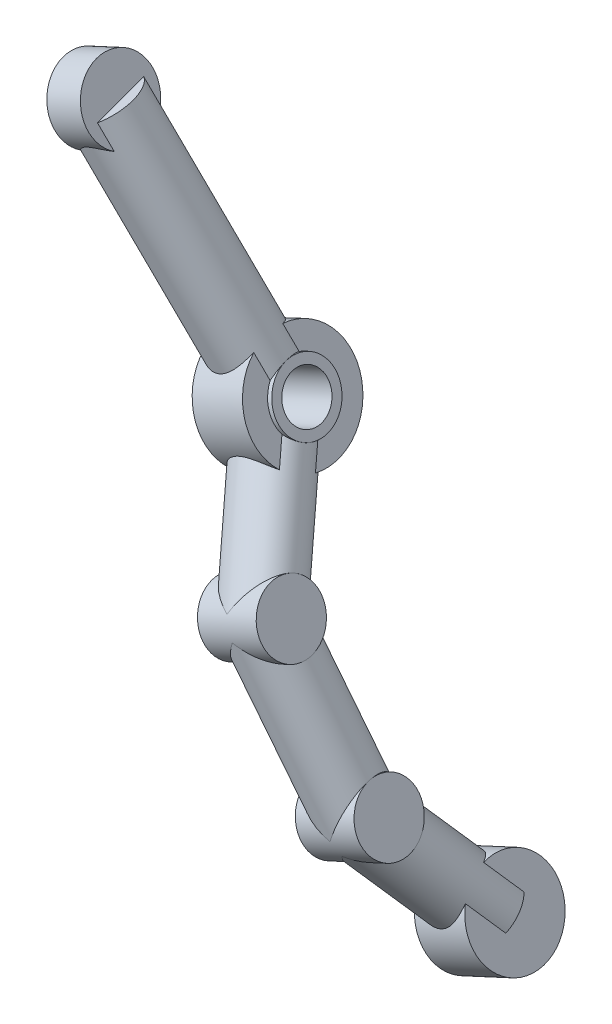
from build123d import *

# Parameters (mm, degrees)
BRAZO_1_PROFILE_R        = 3.5
BRAZO_2_PROFILE_R        = 3.5
BRAZO_3_PROFILE_R        = 3.5
BRAZO_4_PROFILE_R        = 3.5
BRAZO_CODO_1_PROFILE_R   = 3.5
BRAZO_CODO_2_PROFILE_R   = 3.5
BRAZO_CODO_3_PROFILE_R   = 3.5
OJO_PIVOTE_PROFILE_R     = 6
ANCLAJE_CABLE_PROFILE_R  = 4
OJO_ZAPATA_PROFILE_R     = 5
TALADRO_PIVOTE_PROFILE_R = 2.5


with BuildPart() as part:
    # Brazo_1: sweep along a curve in space
    with BuildLine() as brazo_1_path:
        Line((424.61087669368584, 411.57911876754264, 33), (436.3979905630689, 386.1810096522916, 26))
    # Brazo_1 profile (on start of the path) → Brazo_1 (sweep)
    with BuildSketch(Plane(origin=(424.61087669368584, 411.57911876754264, 33), x_dir=(-0.9070753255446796, -0.42096835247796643, 0), z_dir=(0.40839928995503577, -0.8799923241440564, -0.24253562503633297))):
        Circle(BRAZO_1_PROFILE_R)
    sweep(path=brazo_1_path.line)

    # Brazo_2: sweep along a curve in space
    with BuildLine() as brazo_2_path:
        Line((436.3979905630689, 386.1810096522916, 26), (442.7125158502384, 372.5748797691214, 34))
    # Brazo_2 profile (on start of the path) → Brazo_2 (sweep)
    with BuildSketch(Plane(origin=(436.3979905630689, 386.1810096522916, 26), x_dir=(0, -0.5068503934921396, -0.8620340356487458), z_dir=(0.37144266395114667, -0.8003605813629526, 0.47058823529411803))):
        Circle(BRAZO_2_PROFILE_R)
    sweep(path=brazo_2_path.line)

    # Brazo_3: sweep along a curve in space
    with BuildLine() as brazo_3_path:
        Line((442.7125158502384, 372.5748797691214, 34), (450.28994619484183, 356.2475239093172, 31))
    # Brazo_3 profile (on start of the path) → Brazo_3 (sweep)
    with BuildSketch(Plane(origin=(442.7125158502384, 372.5748797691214, 34), x_dir=(-0.9070753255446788, -0.42096835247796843, 0), z_dir=(0.4152406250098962, -0.8947335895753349, -0.16439898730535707))):
        Circle(BRAZO_3_PROFILE_R)
    sweep(path=brazo_3_path.line)

    # Brazo_4: sweep along a curve in space
    with BuildLine() as brazo_4_path:
        Line((450.28994619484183, 356.2475239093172, 31), (455.3415664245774, 345.36262000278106, 22))
    # Brazo_4 profile (on start of the path) → Brazo_4 (sweep)
    with BuildSketch(Plane(origin=(450.28994619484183, 356.2475239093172, 31), x_dir=(0, 0.6372232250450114, -0.7706792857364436), z_dir=(0.33677468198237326, -0.7256602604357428, -0.600000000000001))):
        Circle(BRAZO_4_PROFILE_R)
    sweep(path=brazo_4_path.line)

    # Brazo_codo_1: sweep along a curve in space
    with BuildLine() as brazo_codo_1_path:
        Line((433.22322692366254, 384.7076204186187, 26), (439.57275420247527, 387.6543988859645, 26))
    # Brazo_codo_1 profile (on start of the path) → Brazo_codo_1 (sweep)
    with BuildSketch(Plane(origin=(433.22322692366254, 384.7076204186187, 26), x_dir=(-0.42096835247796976, 0.9070753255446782, 0), z_dir=(0.9070753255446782, 0.42096835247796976, 0))):
        Circle(BRAZO_CODO_1_PROFILE_R)
    sweep(path=brazo_codo_1_path.line)

    # Brazo_codo_2: sweep along a curve in space
    with BuildLine() as brazo_codo_2_path:
        Line((439.537752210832, 371.10149053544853, 34), (445.88727948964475, 374.0482690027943, 34))
    # Brazo_codo_2 profile (on start of the path) → Brazo_codo_2 (sweep)
    with BuildSketch(Plane(origin=(439.537752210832, 371.10149053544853, 34), x_dir=(-0.42096835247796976, 0.9070753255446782, 0), z_dir=(0.9070753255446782, 0.42096835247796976, 0))):
        Circle(BRAZO_CODO_2_PROFILE_R)
    sweep(path=brazo_codo_2_path.line)

    # Brazo_codo_3: sweep along a curve in space
    with BuildLine() as brazo_codo_3_path:
        Line((447.11518255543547, 354.7741346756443, 31), (453.4647098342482, 357.72091314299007, 31))
    # Brazo_codo_3 profile (on start of the path) → Brazo_codo_3 (sweep)
    with BuildSketch(Plane(origin=(447.11518255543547, 354.7741346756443, 31), x_dir=(-0.42096835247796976, 0.9070753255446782, 0), z_dir=(0.9070753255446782, 0.42096835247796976, 0))):
        Circle(BRAZO_CODO_3_PROFILE_R)
    sweep(path=brazo_codo_3_path.line)

    # Ojo_pivote: sweep along a curve in space
    with BuildLine() as ojo_pivote_path:
        Line((433.67676458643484, 384.9181045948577, 26), (439.11921653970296, 387.4439147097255, 26))
    # Ojo_pivote profile (on start of the path) → Ojo_pivote (sweep)
    with BuildSketch(Plane(origin=(433.67676458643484, 384.9181045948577, 26), x_dir=(-0.4209683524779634, 0.9070753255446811, 0), z_dir=(0.9070753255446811, 0.4209683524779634, 0))):
        Circle(OJO_PIVOTE_PROFILE_R)
    sweep(path=ojo_pivote_path.line)

    # Anclaje_cable: sweep along a curve in space
    with BuildLine() as anclaje_cable_path:
        Line((422.79672604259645, 410.7371820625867, 33), (426.4250273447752, 412.4210554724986, 33))
    # Anclaje_cable profile (on start of the path) → Anclaje_cable (sweep)
    with BuildSketch(Plane(origin=(422.79672604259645, 410.7371820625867, 33), x_dir=(-0.4209683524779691, 0.9070753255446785, 0), z_dir=(0.9070753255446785, 0.4209683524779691, 0))):
        Circle(ANCLAJE_CABLE_PROFILE_R)
    sweep(path=anclaje_cable_path.line)

    # Ojo_zapata: sweep along a curve in space
    with BuildLine() as ojo_zapata_path:
        Line((452.62034044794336, 344.09971494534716, 22), (458.0627924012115, 346.62552506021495, 22))
    # Ojo_zapata profile (on start of the path) → Ojo_zapata (sweep)
    with BuildSketch(Plane(origin=(452.62034044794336, 344.09971494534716, 22), x_dir=(-0.4209683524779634, 0.9070753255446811, 0), z_dir=(0.9070753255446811, 0.4209683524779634, 0))):
        Circle(OJO_ZAPATA_PROFILE_R)
    sweep(path=ojo_zapata_path.line)

    # Taladro_pivote: sweep along a curve in space
    with BuildLine() as taladro_pivote_path:
        Line((432.7696892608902, 384.4971362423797, 26), (440.02629186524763, 387.8648830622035, 26))
    # Taladro_pivote profile (on start of the path) → Taladro_pivote (sweep, cut)
    with BuildSketch(Plane(origin=(432.7696892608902, 384.4971362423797, 26), x_dir=(-0.4209683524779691, 0.9070753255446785, 0), z_dir=(0.9070753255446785, 0.4209683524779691, 0))):
        Circle(TALADRO_PIVOTE_PROFILE_R)
    sweep(path=taladro_pivote_path.line, mode=Mode.SUBTRACT)


solid = part.part
